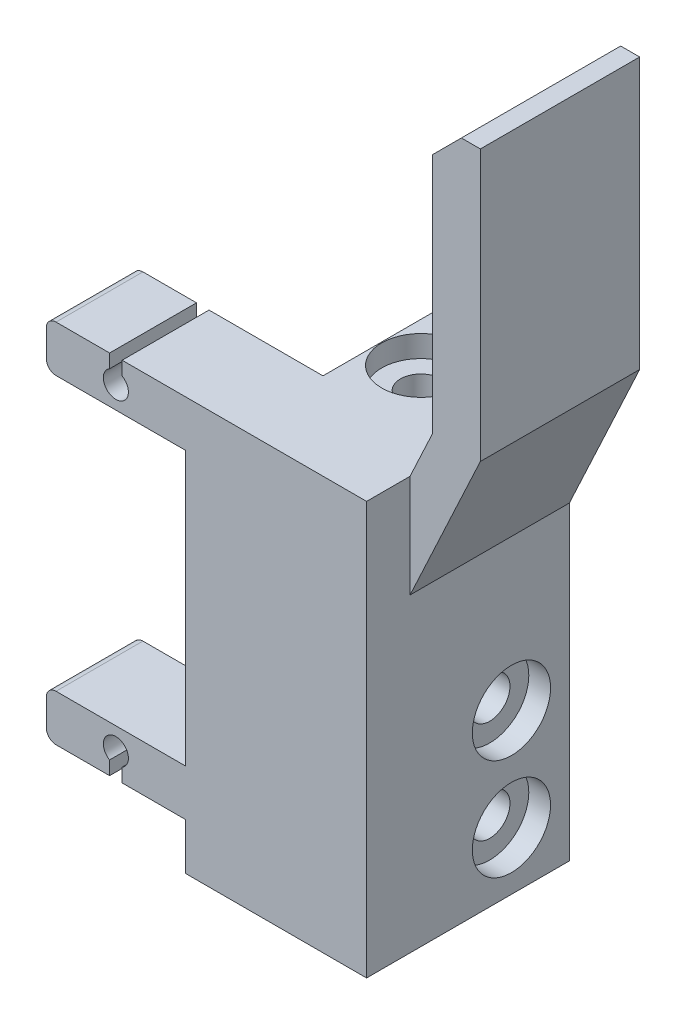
from build123d import *

# Parameters (mm, degrees)
SKETCH1_W                                        = 28.0820114
SKETCH1_H                                        = 36.195
BOSS_EXTRUDE1_DEPTH                              = 17.78
BOSS_EXTRUDE2_DEPTH                              = 13.97
SKETCH3_W                                        = 16.637
SKETCH3_H                                        = 10.16
CUT_EXTRUDE1_DEPTH                               = 43.647422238
SKETCH4_W                                        = 7.0000114
SKETCH4_H                                        = 31.75
CUT_EXTRUDE2_DEPTH                               = 10.16
SKETCH5_W                                        = 12.192
SKETCH5_H                                        = 4.094988
CUT_EXTRUDE3_DEPTH                               = 56.232734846
CUT_EXTRUDE4_DEPTH                               = 56.232734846
SKETCH7_W                                        = 12.192
SKETCH7_H                                        = 23.972012
CUT_EXTRUDE5_DEPTH                               = 56.232734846
CUT_EXTRUDE6_DEPTH                               = 56.232734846
SKETCH9_W                                        = 4.445
SKETCH9_H                                        = 19.05
BOSS_EXTRUDE3_DEPTH                              = 10.16
SKETCH10_W                                       = 1.0999978
SKETCH10_H                                       = 7.62
SKETCH11_W                                       = 1.0999978
SKETCH11_H                                       = 7.62
CBORE_FOR_M3_HEX_HEAD_MACHINE_SCREW1_D           = 3.556
CBORE_FOR_M3_HEX_HEAD_MACHINE_SCREW1_DEPTH       = 4.445
CBORE_FOR_M3_HEX_HEAD_MACHINE_SCREW1_CBORE_D     = 6.858
CBORE_FOR_M3_HEX_HEAD_MACHINE_SCREW1_CBORE_DEPTH = 1.905
CBORE_FOR_M3_HEX_HEAD_MACHINE_SCREW2_D           = 3.556
CBORE_FOR_M3_HEX_HEAD_MACHINE_SCREW2_DEPTH       = 36.195
CBORE_FOR_M3_HEX_HEAD_MACHINE_SCREW2_CBORE_D     = 6.858
CBORE_FOR_M3_HEX_HEAD_MACHINE_SCREW2_CBORE_DEPTH = 1.905
CBORE_FOR_M3_HEX_HEAD_MACHINE_SCREW3_D           = 3.556
CBORE_FOR_M3_HEX_HEAD_MACHINE_SCREW3_DEPTH       = 22.054875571
CBORE_FOR_M3_HEX_HEAD_MACHINE_SCREW3_CBORE_D     = 6.858
CBORE_FOR_M3_HEX_HEAD_MACHINE_SCREW3_CBORE_DEPTH = 1.905
CHAMFER1_SIZE                                    = 4.205365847
CHAMFER1_SIZE2                                   = 1.9609943
FILLET1_R                                        = 0.850011


with BuildPart() as part:
    # Sketch1 → Boss-Extrude1 (new body)
    with BuildSketch(Plane(origin=(0, 0, -10.16), x_dir=(-1, 0, 0), z_dir=(0, 0, -1))):
        with Locations((6.096, 2.2225)):
            Rectangle(SKETCH1_W, SKETCH1_H)
    extrude(amount=-BOSS_EXTRUDE1_DEPTH)

    # Sketch2 → Boss-Extrude2 (add)
    with BuildSketch(Plane(origin=(0, 0, -10.16), x_dir=(-1, 0, 0), z_dir=(0, 0, -1))):
        Polygon((-12.446, 48.26), (-14.109869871, 48.26), (-14.109869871, 24.525365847), (-7.9450057, 11.304771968), (-7.9450057, 20.32), (-9.906, 20.32), (-9.906, 45.72), align=None)
    extrude(amount=-BOSS_EXTRUDE2_DEPTH)

    # Sketch3 → Cut-Extrude1 (cut, through all)
    with BuildSketch(Plane(origin=(0, 20.32, 0), x_dir=(-1, 0, 0), z_dir=(0, 1, 0))):
        with Locations((11.8185057, -5.08)):
            Rectangle(SKETCH3_W, SKETCH3_H)
    extrude(amount=-CUT_EXTRUDE1_DEPTH, mode=Mode.SUBTRACT)

    # Sketch4 → Cut-Extrude2 (cut)
    with BuildSketch(Plane(origin=(0, 0, -10.16), x_dir=(-1, 0, 0), z_dir=(0, 0, -1))):
        Rectangle(SKETCH4_W, SKETCH4_H)
    extrude(amount=-CUT_EXTRUDE2_DEPTH, mode=Mode.SUBTRACT)

    # Sketch5 → Cut-Extrude3 (cut, through all)
    with BuildSketch(Plane.XY.offset(7.62)):
        with Locations((-14.0410057, -13.827506)):
            Rectangle(SKETCH5_W, SKETCH5_H)
    extrude(amount=-CUT_EXTRUDE3_DEPTH, mode=Mode.SUBTRACT)

    # Sketch6 → Cut-Extrude4 (cut, through all)
    with BuildSketch(Plane.XY.offset(7.62)):
        with BuildLine():
            Line((-13.4910068, -11.780012), (-13.4910068, -10.582629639))
            ThreePointArc((-13.4910068, -10.582629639), (-14.0410057, -10.7300014), (-14.5910046, -10.582629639))
            Line((-14.5910046, -10.582629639), (-14.5910046, -11.780012))
            Line((-14.5910046, -11.780012), (-13.4910068, -11.780012))
        make_face()
    extrude(amount=-CUT_EXTRUDE4_DEPTH, mode=Mode.SUBTRACT)

    # Sketch7 → Cut-Extrude5 (cut, through all)
    with BuildSketch(Plane.XY.offset(7.62)):
        with Locations((-14.0410057, 4.269994)):
            Rectangle(SKETCH7_W, SKETCH7_H)
    extrude(amount=-CUT_EXTRUDE5_DEPTH, mode=Mode.SUBTRACT)

    # Sketch8 → Cut-Extrude6 (cut, through all)
    with BuildSketch(Plane.XY.offset(7.62)):
        with BuildLine():
            Line((-14.5910046, 20.32), (-14.5910046, 19.122617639))
            ThreePointArc((-14.5910046, 19.122617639), (-14.0410057, 19.2699894), (-13.4910068, 19.122617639))
            Line((-13.4910068, 19.122617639), (-13.4910068, 20.32))
            Line((-13.4910068, 20.32), (-14.5910046, 20.32))
        make_face()
    extrude(amount=-CUT_EXTRUDE6_DEPTH, mode=Mode.SUBTRACT)

    # Sketch9 → Boss-Extrude3 (add)
    with BuildSketch(Plane(origin=(0, 0, 0), x_dir=(-1, 0, 0), z_dir=(0, 0, -1))):
        with Locations((5.7225057, -6.35)):
            Rectangle(SKETCH9_W, SKETCH9_H)
    extrude(amount=BOSS_EXTRUDE3_DEPTH)

    # Sketch10 → Cut-Revolve1 (revolve, cut)
    with BuildSketch(Plane.XZ.offset(-18.1699916)):
        with Locations((-13.4910068, 3.81)):
            Rectangle(SKETCH10_W, SKETCH10_H)
    revolve(axis=Axis((-14.0410057, 18.1699916, 7.62), (0, 0, -1)), mode=Mode.SUBTRACT)

    # Sketch11 → Cut-Revolve2 (revolve, cut)
    with BuildSketch(Plane(origin=(0, -9.6300036, 0), x_dir=(1, 0, 0), z_dir=(0, 1, 0))):
        with Locations((-13.4910068, -3.81)):
            Rectangle(SKETCH11_W, SKETCH11_H)
    revolve(axis=Axis((-14.0410057, -9.6300036, 0), (0, 0, 1)), mode=Mode.SUBTRACT)

    # CBORE for M3 Hex Head Machine Screw1
    with Locations(Plane(origin=(7.9450057, 0, 0), x_dir=(0, 0, -1), z_dir=(1, 0, 0))):
        with Locations((5.08, -1.905), (5.08, -10.795)):
            CounterBoreHole(CBORE_FOR_M3_HEX_HEAD_MACHINE_SCREW1_D / 2, CBORE_FOR_M3_HEX_HEAD_MACHINE_SCREW1_CBORE_D / 2, CBORE_FOR_M3_HEX_HEAD_MACHINE_SCREW1_CBORE_DEPTH, depth=CBORE_FOR_M3_HEX_HEAD_MACHINE_SCREW1_DEPTH)

    # CBORE for M3 Hex Head Machine Screw2
    with Locations(Plane(origin=(0, 20.32, 0), x_dir=(1, 0, 0), z_dir=(0, 1, 0))):
        with Locations((0, 5.08)):
            CounterBoreHole(CBORE_FOR_M3_HEX_HEAD_MACHINE_SCREW2_D / 2, CBORE_FOR_M3_HEX_HEAD_MACHINE_SCREW2_CBORE_D / 2, CBORE_FOR_M3_HEX_HEAD_MACHINE_SCREW2_CBORE_DEPTH, depth=CBORE_FOR_M3_HEX_HEAD_MACHINE_SCREW2_DEPTH)

    # CBORE for M3 Hex Head Machine Screw3
    with Locations(Plane.ZY.offset(7.9450057)):
        with Locations((-5.08, -1.905), (-5.08, -10.795)):
            CounterBoreHole(CBORE_FOR_M3_HEX_HEAD_MACHINE_SCREW3_D / 2, CBORE_FOR_M3_HEX_HEAD_MACHINE_SCREW3_CBORE_D / 2, CBORE_FOR_M3_HEX_HEAD_MACHINE_SCREW3_CBORE_DEPTH, depth=CBORE_FOR_M3_HEX_HEAD_MACHINE_SCREW3_DEPTH)

    # Chamfer1
    chamfer1_edges = [part.edges().sort_by_distance(p)[0] for p in [
        (9.906, 20.32, -3.175),
    ]]
    chamfer1_side = [part.faces().sort_by_distance(p)[0] for p in [
        (9.906, 33.02, -3.175),
    ]]
    chamfer(chamfer1_edges, length=CHAMFER1_SIZE, length2=CHAMFER1_SIZE2, reference=chamfer1_side[0])

    # Fillet1
    fillet1_edges = [part.edges().sort_by_distance(p)[0] for p in [
        (-20.1370057, 16.256, 3.81),
        (-20.1370057, -7.716012, 3.81),
        (-20.1370057, -11.780012, 3.81),
        (-20.1370057, 20.32, 3.81),
    ]]
    fillet(fillet1_edges, radius=FILLET1_R)


solid = part.part
